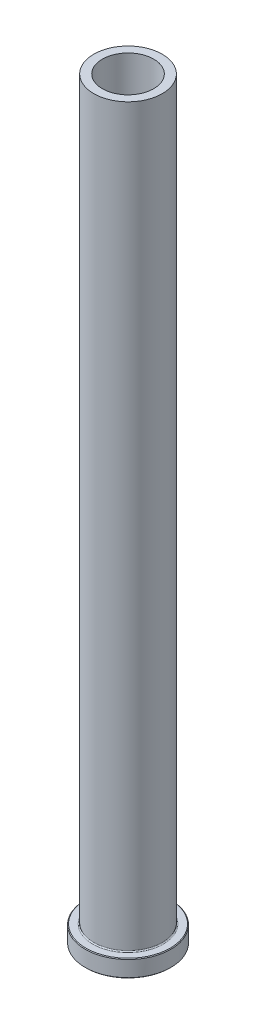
from build123d import *

# Parameters (mm, degrees)
CHAMFER1_SIZE = 0.254


with BuildPart() as part:
    # Sketch1 → Revolve1 (revolve)
    with BuildSketch(Plane.XY, mode=Mode.PRIVATE) as revolve1_sk:
        with BuildLine():
            Line((0, 0), (15.875, 0))
            Line((15.875, 0), (15.875, 6.35))
            Line((15.875, 6.35), (13.090525, 6.35))
            ThreePointArc((13.090525, 6.35), (12.809891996, 6.466241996), (12.69365, 6.746875))
            Line((12.69365, 6.746875), (12.69365, 279.4))
            Line((12.69365, 279.4), (0, 279.4))
            Line((0, 279.4), (0, 0))
        make_face()
    revolve(revolve1_sk.sketch.rotate(Axis((0, 0, 0), (0, 1, 0)), 90), axis=Axis((0, 0, 0), (0, 1, 0)))

    # Sketch2 → Cut-Revolve1 (revolve, cut)
    with BuildSketch(Plane.XY, mode=Mode.PRIVATE) as cut_revolve1_sk:
        Polygon((10.112375, 0), (9.7155, 0.396875), (9.7155, 204.9145), (9.525, 219.202), (9.525, 279.4), (0, 279.4), (0, 0), align=None)
    revolve(cut_revolve1_sk.sketch.rotate(Axis((0, 0, 0), (0, 1, 0)), 90), axis=Axis((0, 0, 0), (0, 1, 0)), mode=Mode.SUBTRACT)

    # Chamfer1
    chamfer1_edges = [part.edges().sort_by_distance(p)[0] for p in [
        (0, 6.35, 15.875),
        (0, 0, 15.875),
    ]]
    chamfer(chamfer1_edges, length=CHAMFER1_SIZE)


solid = part.part
